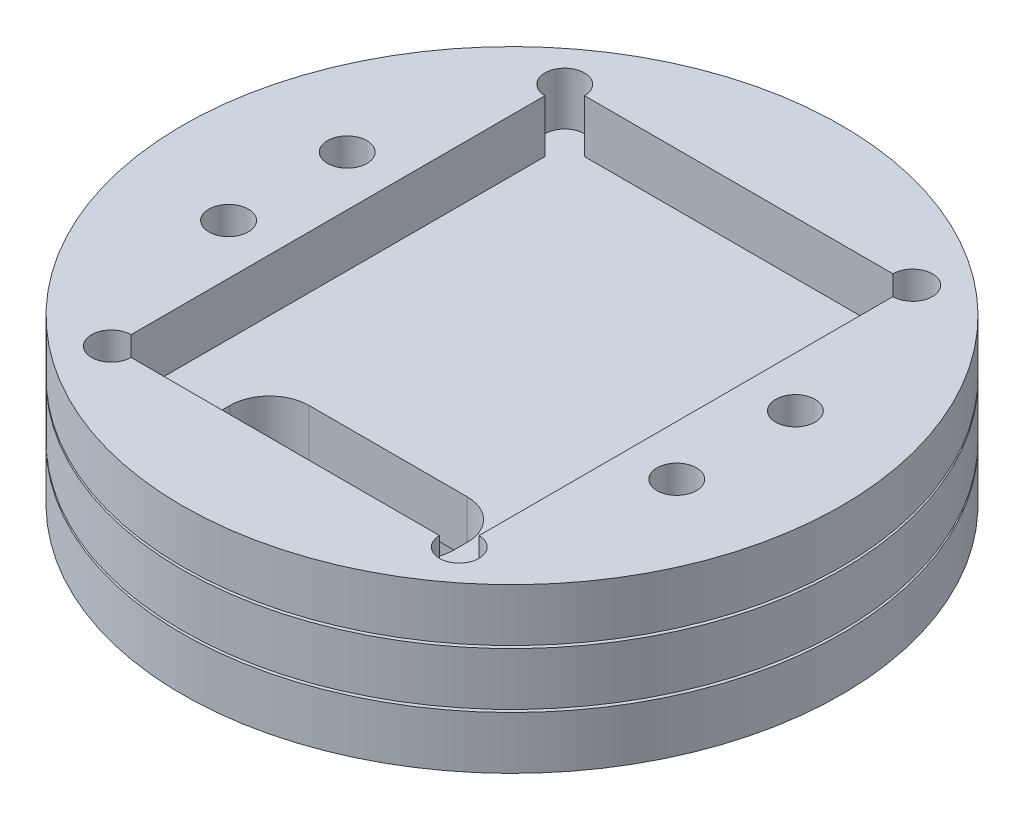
from build123d import *

# Parameters (mm, degrees)
SKETCH1_R           = 3.175
EXTRUDE1_DEPTH      = 0.508
SKETCH2_R           = 0.1905
EXTRUDE2_DEPTH      = 5.518773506
SKETCH5_R           = 0.1905
EXTRUDE5_DEPTH      = 0.0254
SKETCH11_R          = 3.175
SKETCH11_R_2        = 0.1905
BOSS_EXTRUDE1_DEPTH = 0.508
SKETCH14_R          = 0.381
SKETCH14_R_2        = 0.1905
BOSS_EXTRUDE2_DEPTH = 0.0254
BOSS_EXTRUDE3_START = 0.5334
SKETCH15_R          = 3.175
SKETCH15_R_2        = 0.1905
BOSS_EXTRUDE3_DEPTH = 0.508


with BuildPart() as part:
    # Sketch1 → Extrude1 (new body)
    with BuildSketch(Plane(origin=(0, 0, 0), x_dir=(1, 0, 0), z_dir=(0, 1, 0))):
        with Locations(Location((0, 0, 0), (0, 0, 270))):
            Circle(SKETCH1_R)
        with BuildLine():
            Line((-0.762, -2.0828), (0.762, -2.0828))
            ThreePointArc((0.762, -2.0828), (1.031407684, -1.971207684), (1.143, -1.7018))
            Line((1.143, -1.7018), (1.143, -1.5748))
            ThreePointArc((1.143, -1.5748), (1.031407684, -1.305392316), (0.762, -1.1938))
            Line((0.762, -1.1938), (-0.762, -1.1938))
            ThreePointArc((-0.762, -1.1938), (-1.031407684, -1.305392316), (-1.143, -1.5748))
            Line((-1.143, -1.5748), (-1.143, -1.7018))
            ThreePointArc((-1.143, -1.7018), (-1.031407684, -1.971207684), (-0.762, -2.0828))
        make_face(mode=Mode.SUBTRACT)
    extrude(amount=EXTRUDE1_DEPTH)

    # Sketch2 → Extrude2 (cut, through all)
    with BuildSketch(Plane(origin=(0, 0.508, 0), x_dir=(1, 0, 0), z_dir=(0, 1, 0))):
        with Locations(Location((2.159, -0.5715, 0), (0, 0, 270))):
            Circle(SKETCH2_R)
        with Locations(Location((-2.159, -0.5715, 0), (0, 0, 270))):
            Circle(SKETCH2_R)
        with Locations(Location((2.159, 0.5715, 0), (0, 0, 270))):
            Circle(SKETCH2_R)
        with Locations(Location((-2.159, 0.5715, 0), (0, 0, 270))):
            Circle(SKETCH2_R)
    extrude(amount=-EXTRUDE2_DEPTH, mode=Mode.SUBTRACT)

    # Sketch5 → Extrude5 (add)
    # profile 1 of 4: a face of its own
    with BuildSketch(Plane.XZ):
        with BuildLine():
            Line((-0.3175, 2.0828), (0.3175, 2.0828))
            Line((0.3175, 2.0828), (0.3175, 2.5908))
            Line((0.3175, 2.5908), (0.762, 2.5908))
            ThreePointArc((0.762, 2.5908), (1.390617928, 2.330417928), (1.651, 1.7018))
            Line((1.651, 1.7018), (1.651, 0.4191))
            Line((1.651, 0.4191), (1.809807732, 0.4191))
            ThreePointArc((1.809807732, 0.4191), (2.523166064, 0.459499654), (1.9558, 0.89378987))
            Line((1.9558, 0.89378987), (1.9558, 1.7018))
            ThreePointArc((1.9558, 1.7018), (1.606144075, 2.545944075), (0.762, 2.8956))
            Line((0.762, 2.8956), (-0.3175, 2.8956))
            Line((-0.3175, 2.8956), (-0.3175, 2.0828))
        make_face()
        with Locations(Location((2.159, 0.5715, 0), (0, 0, 90))):
            Circle(SKETCH5_R, mode=Mode.SUBTRACT)
    # profile 2 of 4: a face of its own
    with BuildSketch(Plane.XZ):
        with BuildLine():
            Line((-1.809807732, 0.4191), (-1.143, 0.4191))
            Line((-1.143, 0.4191), (-1.143, 1.7018))
            ThreePointArc((-1.143, 1.7018), (-1.031407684, 1.971207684), (-0.762, 2.0828))
            Line((-0.762, 2.0828), (-0.5969, 2.0828))
            Line((-0.5969, 2.0828), (-0.5969, 2.3876))
            Line((-0.5969, 2.3876), (-0.762, 2.3876))
            ThreePointArc((-0.762, 2.3876), (-1.246933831, 2.186733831), (-1.4478, 1.7018))
            Line((-1.4478, 1.7018), (-1.4478, 0.7239))
            Line((-1.4478, 0.7239), (-1.809807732, 0.7239))
            ThreePointArc((-1.809807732, 0.7239), (-2.54, 0.5715), (-1.809807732, 0.4191))
        make_face()
        with Locations(Location((-2.159, 0.5715, 0), (0, 0, 90))):
            Circle(SKETCH5_R, mode=Mode.SUBTRACT)
    # profile 3 of 4: a face of its own
    with BuildSketch(Plane.XZ):
        with BuildLine():
            Line((0.5969, 2.0828), (0.762, 2.0828))
            ThreePointArc((0.762, 2.0828), (1.031407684, 1.971207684), (1.143, 1.7018))
            Line((1.143, 1.7018), (1.143, -0.7239))
            Line((1.143, -0.7239), (1.809807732, -0.7239))
            ThreePointArc((1.809807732, -0.7239), (2.54, -0.5715), (1.809807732, -0.4191))
            Line((1.809807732, -0.4191), (1.4478, -0.4191))
            Line((1.4478, -0.4191), (1.4478, 1.7018))
            ThreePointArc((1.4478, 1.7018), (1.246933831, 2.186733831), (0.762, 2.3876))
            Line((0.762, 2.3876), (0.5969, 2.3876))
            Line((0.5969, 2.3876), (0.5969, 2.0828))
        make_face()
        with Locations(Location((2.159, -0.5715, 0), (0, 0, 90))):
            Circle(SKETCH5_R, mode=Mode.SUBTRACT)
    # profile 4 of 4: a face of its own
    with BuildSketch(Plane.XZ):
        with BuildLine():
            Line((-2.159, -0.1905), (-1.143, -0.1905))
            Line((-1.143, -0.1905), (-1.143, -1.27))
            Line((-1.143, -1.27), (2.199704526, -1.27))
            ThreePointArc((2.199704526, -1.27), (-0.21545231, -2.530845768), (-2.382726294, -0.879895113))
            ThreePointArc((-2.382726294, -0.879895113), (-2.521394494, -0.453893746), (-2.159, -0.1905))
        make_face()
        with Locations(Location((-2.159, -0.5715, 0), (0, 0, 90))):
            Circle(SKETCH5_R, mode=Mode.SUBTRACT)
    extrude(amount=EXTRUDE5_DEPTH)

    # Sketch11 → Boss-Extrude1 (add)
    with BuildSketch(Plane.XZ.offset(0.0254)):
        with Locations(Location((0, 0, 0), (0, 0, 90))):
            Circle(SKETCH11_R)
        with Locations(Location((-2.159, 0.5715, 0), (0, 0, 90))):
            Circle(SKETCH11_R_2, mode=Mode.SUBTRACT)
        with Locations(Location((-2.159, -0.5715, 0), (0, 0, 90))):
            Circle(SKETCH11_R_2, mode=Mode.SUBTRACT)
        with Locations(Location((2.159, 0.5715, 0), (0, 0, 90))):
            Circle(SKETCH11_R_2, mode=Mode.SUBTRACT)
        with Locations(Location((2.159, -0.5715, 0), (0, 0, 90))):
            Circle(SKETCH11_R_2, mode=Mode.SUBTRACT)
        with BuildLine():
            Line((-1.27, 2.286), (-1.27, 1.524))
            ThreePointArc((-1.27, 1.524), (-1.158407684, 1.254592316), (-0.889, 1.143))
            Line((-0.889, 1.143), (0.889, 1.143))
            ThreePointArc((0.889, 1.143), (1.158407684, 1.254592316), (1.27, 1.524))
            Line((1.27, 1.524), (1.27, 2.286))
            ThreePointArc((1.27, 2.286), (1.158407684, 2.555407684), (0.889, 2.667))
            Line((0.889, 2.667), (-0.889, 2.667))
            ThreePointArc((-0.889, 2.667), (-1.158407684, 2.555407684), (-1.27, 2.286))
        make_face(mode=Mode.SUBTRACT)
    extrude(amount=BOSS_EXTRUDE1_DEPTH)

    # Sketch14 → Boss-Extrude2 (add)
    # profile 1 of 4: a face of its own
    with BuildSketch(Plane.XZ.offset(0.5334)):
        with Locations(Location((-2.159, 0.5715, 0), (0, 0, 270))):
            Circle(SKETCH14_R)
        with Locations(Location((-2.159, 0.5715, 0), (0, 0, 90))):
            Circle(SKETCH14_R_2, mode=Mode.SUBTRACT)
    # profile 2 of 4: a face of its own
    with BuildSketch(Plane.XZ.offset(0.5334)):
        with Locations(Location((-2.159, -0.5715, 0), (0, 0, 270))):
            Circle(SKETCH14_R)
        with Locations(Location((-2.159, -0.5715, 0), (0, 0, 90))):
            Circle(SKETCH14_R_2, mode=Mode.SUBTRACT)
    # profile 3 of 4: a face of its own
    with BuildSketch(Plane.XZ.offset(0.5334)):
        with Locations(Location((2.159, -0.5715, 0), (0, 0, 270))):
            Circle(SKETCH14_R)
        with Locations(Location((2.159, -0.5715, 0), (0, 0, 90))):
            Circle(SKETCH14_R_2, mode=Mode.SUBTRACT)
    # profile 4 of 4: a face of its own
    with BuildSketch(Plane.XZ.offset(0.5334)):
        with Locations(Location((2.159, 0.5715, 0), (0, 0, 270))):
            Circle(SKETCH14_R)
        with Locations(Location((2.159, 0.5715, 0), (0, 0, 90))):
            Circle(SKETCH14_R_2, mode=Mode.SUBTRACT)
    extrude(amount=BOSS_EXTRUDE2_DEPTH)


with BuildPart() as body_2:
    # Sketch15 → Boss-Extrude3 (new body)
    with BuildSketch(Plane(origin=(0, 0.508, 0), x_dir=(1, 0, 0), z_dir=(0, 1, 0)).offset(BOSS_EXTRUDE3_START)):
        with Locations(Location((0, 0, 0), (0, 0, 270))):
            Circle(SKETCH15_R)
        with Locations(Location((-2.159, 0.5715, 0), (0, 0, 270))):
            Circle(SKETCH15_R_2, mode=Mode.SUBTRACT)
        with Locations(Location((-2.159, -0.5715, 0), (0, 0, 270))):
            Circle(SKETCH15_R_2, mode=Mode.SUBTRACT)
        with Locations(Location((2.159, 0.5715, 0), (0, 0, 270))):
            Circle(SKETCH15_R_2, mode=Mode.SUBTRACT)
        with Locations(Location((2.159, -0.5715, 0), (0, 0, 270))):
            Circle(SKETCH15_R_2, mode=Mode.SUBTRACT)
        with BuildLine():
            Line((-1.4859, -2.1844), (1.4859, -2.1844))
            ThreePointArc((1.4859, -2.1844), (1.811103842, -2.319103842), (1.6764, -1.9939))
            Line((1.6764, -1.9939), (1.6764, 1.9939))
            ThreePointArc((1.6764, 1.9939), (1.811103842, 2.319103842), (1.4859, 2.1844))
            Line((1.4859, 2.1844), (-1.4859, 2.1844))
            ThreePointArc((-1.4859, 2.1844), (-1.811103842, 2.319103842), (-1.6764, 1.9939))
            Line((-1.6764, 1.9939), (-1.6764, -1.9939))
            ThreePointArc((-1.6764, -1.9939), (-1.811103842, -2.319103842), (-1.4859, -2.1844))
        make_face(mode=Mode.SUBTRACT)
    extrude(amount=-BOSS_EXTRUDE3_DEPTH)


solid = Compound([part.part, body_2.part])
